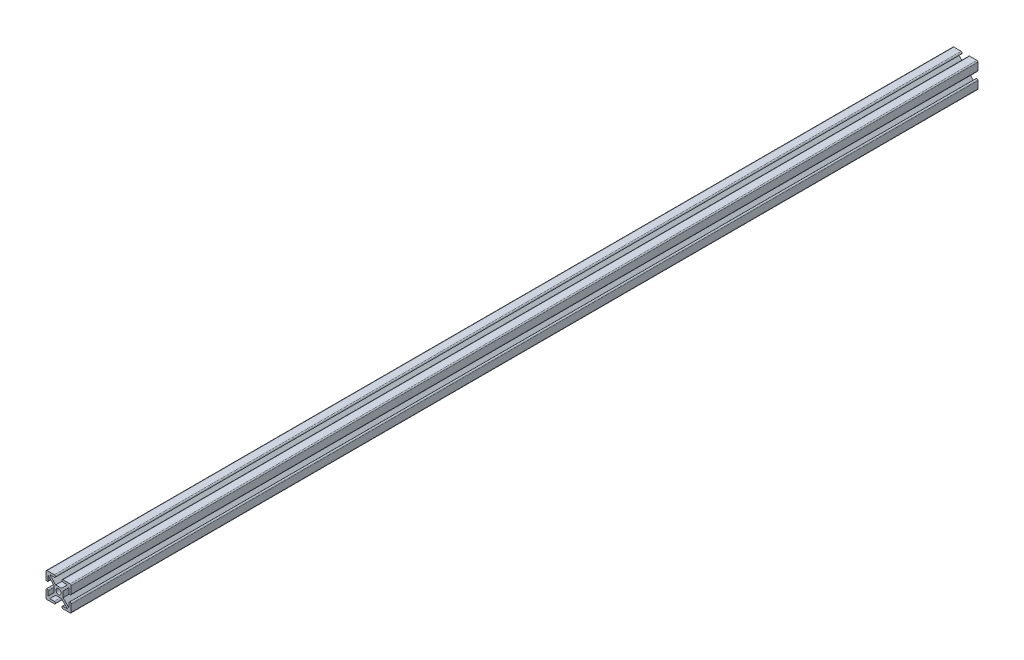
from build123d import *

# Parameters (mm, degrees)
SKETCH1_W           = 9.017
SKETCH1_H           = 9.017
SKETCH1_R           = 2.6035
BOSS_EXTRUDE1_DEPTH = 457.2


with BuildPart() as part:
    # Sketch1 → Boss-Extrude1 (new, symmetric)
    # profile 1 of 9: a face of its own
    with BuildSketch(Plane.XY):
        with BuildLine():
            Line((-4.3434, 12.7), (-11.5951, 12.7))
            ThreePointArc((-11.5951, 12.7), (-12.376382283, 12.376382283), (-12.7, 11.5951))
            Line((-12.7, 11.5951), (-12.7, 4.3434))
            ThreePointArc((-12.7, 4.3434), (-11.5951, 3.2385), (-10.4902, 4.3434))
            Line((-10.4902, 4.3434), (-10.4902, 8.927635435))
            Line((-10.4902, 8.927635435), (-8.927635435, 10.4902))
            Line((-8.927635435, 10.4902), (-4.3434, 10.4902))
            ThreePointArc((-4.3434, 10.4902), (-3.2385, 11.5951), (-4.3434, 12.7))
        make_face()
    # profile 2 of 9: a face of its own
    with BuildSketch(Plane.XY):
        Polygon((-4.5085, 4.5085), (-2.945935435, 4.5085), (-8.927635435, 10.4902), (-10.4902, 8.927635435), (-4.5085, 2.945935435), align=None)
    # profile 3 of 9: a face of its own
    with BuildSketch(Plane.XY):
        Rectangle(SKETCH1_W, SKETCH1_H)
        Circle(SKETCH1_R, mode=Mode.SUBTRACT)
    # profile 4 of 9: a face of its own
    with BuildSketch(Plane.XY):
        with BuildLine():
            Line((12.7, 4.3434), (12.7, 11.5951))
            ThreePointArc((12.7, 11.5951), (12.376382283, 12.376382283), (11.5951, 12.7))
            Line((11.5951, 12.7), (4.3434, 12.7))
            ThreePointArc((4.3434, 12.7), (3.2385, 11.5951), (4.3434, 10.4902))
            Line((4.3434, 10.4902), (8.927635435, 10.4902))
            Line((8.927635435, 10.4902), (10.4902, 8.927635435))
            Line((10.4902, 8.927635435), (10.4902, 4.3434))
            ThreePointArc((10.4902, 4.3434), (11.5951, 3.2385), (12.7, 4.3434))
        make_face()
    # profile 5 of 9: a face of its own
    with BuildSketch(Plane.XY):
        Polygon((8.927635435, 10.4902), (2.945935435, 4.5085), (4.5085, 4.5085), (4.5085, 2.945935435), (10.4902, 8.927635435), align=None)
    # profile 6 of 9: a face of its own
    with BuildSketch(Plane.XY):
        Polygon((10.4902, -8.927635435), (4.5085, -2.945935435), (4.5085, -4.5085), (2.945935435, -4.5085), (8.927635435, -10.4902), align=None)
    # profile 7 of 9: a face of its own
    with BuildSketch(Plane.XY):
        with BuildLine():
            Line((4.3434, -12.7), (11.5951, -12.7))
            ThreePointArc((11.5951, -12.7), (12.376382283, -12.376382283), (12.7, -11.5951))
            Line((12.7, -11.5951), (12.7, -4.3434))
            ThreePointArc((12.7, -4.3434), (11.5951, -3.2385), (10.4902, -4.3434))
            Line((10.4902, -4.3434), (10.4902, -8.927635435))
            Line((10.4902, -8.927635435), (8.927635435, -10.4902))
            Line((8.927635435, -10.4902), (4.3434, -10.4902))
            ThreePointArc((4.3434, -10.4902), (3.2385, -11.5951), (4.3434, -12.7))
        make_face()
    # profile 8 of 9: a face of its own
    with BuildSketch(Plane.XY):
        with BuildLine():
            Line((-12.7, -4.3434), (-12.7, -11.5951))
            ThreePointArc((-12.7, -11.5951), (-12.376382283, -12.376382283), (-11.5951, -12.7))
            Line((-11.5951, -12.7), (-4.3434, -12.7))
            ThreePointArc((-4.3434, -12.7), (-3.2385, -11.5951), (-4.3434, -10.4902))
            Line((-4.3434, -10.4902), (-8.927635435, -10.4902))
            Line((-8.927635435, -10.4902), (-10.4902, -8.927635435))
            Line((-10.4902, -8.927635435), (-10.4902, -4.3434))
            ThreePointArc((-10.4902, -4.3434), (-11.5951, -3.2385), (-12.7, -4.3434))
        make_face()
    # profile 9 of 9: a face of its own
    with BuildSketch(Plane.XY):
        Polygon((-4.5085, -4.5085), (-4.5085, -2.945935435), (-10.4902, -8.927635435), (-8.927635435, -10.4902), (-2.945935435, -4.5085), align=None)
    extrude(amount=BOSS_EXTRUDE1_DEPTH, both=True)


solid = part.part
